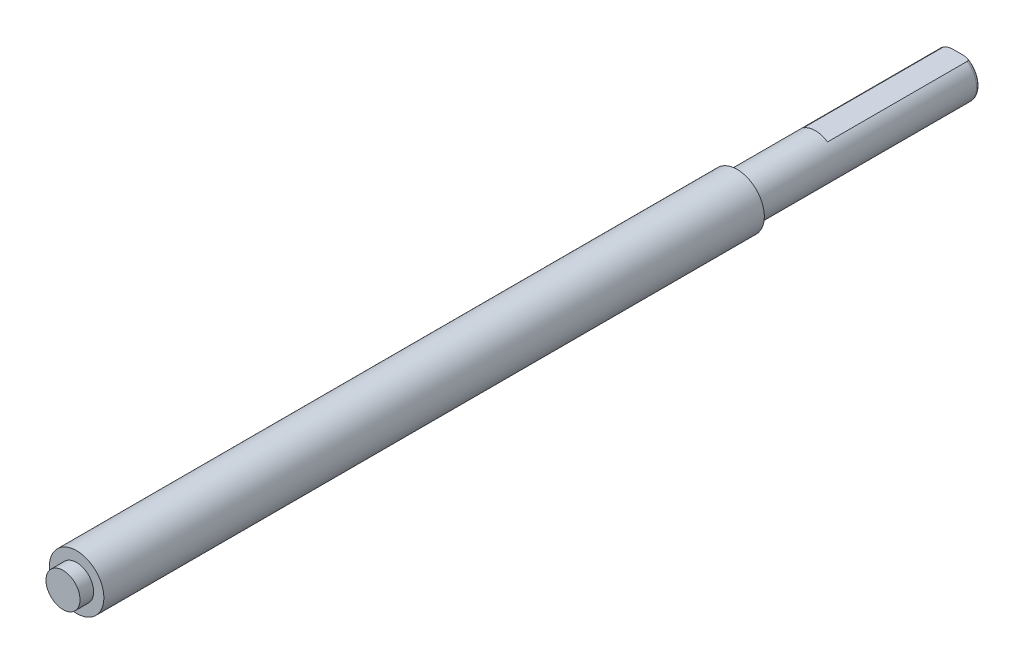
from build123d import *

# Parameters (mm, degrees)
SKETCH_2_R          = 3.175
EXTRUDE_1_DEPTH     = 32.5
SKETCH_3_R          = 4
EXTRUDE_2_DEPTH     = 97
CUT_EXTRUDE_1_DEPTH = 21
FILLET_1_R          = 0.5
SKETCH_5_R          = 2.5
EXTRUDE_3_DEPTH     = 2


with BuildPart() as part:
    # Sketch 2 → Extrude 1 (new body)
    with BuildSketch(Plane.XY):
        Circle(SKETCH_2_R)
    extrude(amount=EXTRUDE_1_DEPTH)

    # Sketch 3 → Extrude 2 (add)
    with BuildSketch(Plane.XY.offset(32.5)):
        with Locations(Location((0, 0, 0), (0, 0, 180))):
            Circle(SKETCH_3_R)
    extrude(amount=EXTRUDE_2_DEPTH)

    # Sketch 4 → Cut-Extrude 1 (cut)
    with BuildSketch(Plane(origin=(0, 0, 0), x_dir=(-1, 0, 0), z_dir=(0, 0, -1))):
        with BuildLine():
            Line((-1.78605711, 2.625), (1.78605711, 2.625))
            ThreePointArc((1.78605711, 2.625), (0, 3.175), (-1.78605711, 2.625))
        make_face()
    extrude(amount=-CUT_EXTRUDE_1_DEPTH, mode=Mode.SUBTRACT)

    # Fillet 1
    fillet_1_edges = [part.edges().sort_by_distance(p)[0] for p in [
        (-1.48490634, -2.806363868, 0),
    ]]
    fillet(fillet_1_edges, radius=FILLET_1_R)

    # Sketch 5 → Extrude 3 (add)
    with BuildSketch(Plane.XY.offset(129.5)):
        Circle(SKETCH_5_R)
    extrude(amount=EXTRUDE_3_DEPTH)


solid = part.part
